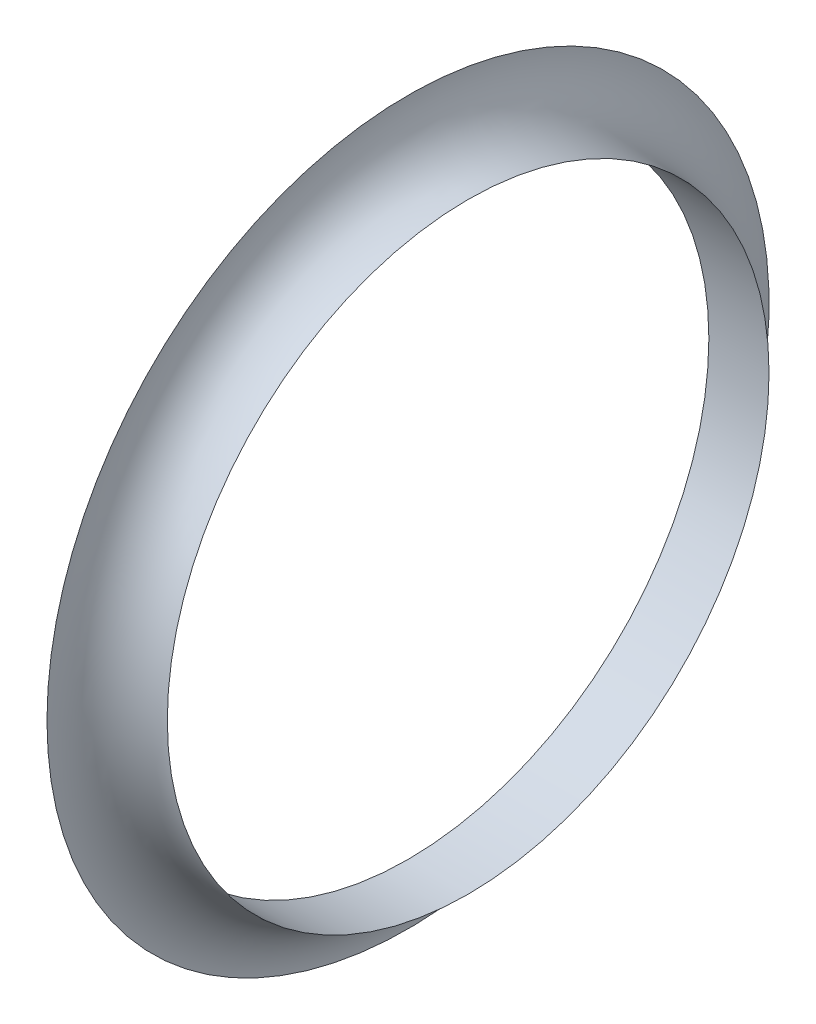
ISO-10303-21;
HEADER;
FILE_DESCRIPTION(('STEP AP214'),'2;1');
FILE_NAME('part.step','',(''),(''),'','','');
FILE_SCHEMA(('AUTOMOTIVE_DESIGN { 1 0 10303 214 1 1 1 1 }'));
ENDSEC;
DATA;
#1=APPLICATION_CONTEXT('core data for automotive mechanical design processes');
#2=APPLICATION_PROTOCOL_DEFINITION('international standard','automotive_design',2000,#1);
#3=PRODUCT_CONTEXT('',#1,'mechanical');
#4=PRODUCT('Part','Part','',(#3));
#5=PRODUCT_RELATED_PRODUCT_CATEGORY('part','',(#4));
#6=PRODUCT_DEFINITION_FORMATION('','',#4);
#7=PRODUCT_DEFINITION_CONTEXT('part definition',#1,'design');
#8=PRODUCT_DEFINITION('design','',#6,#7);
#9=PRODUCT_DEFINITION_SHAPE('','',#8);
#10=(LENGTH_UNIT() NAMED_UNIT(*) SI_UNIT(.MILLI.,.METRE.));
#11=(NAMED_UNIT(*) PLANE_ANGLE_UNIT() SI_UNIT($,.RADIAN.));
#12=(NAMED_UNIT(*) SI_UNIT($,.STERADIAN.) SOLID_ANGLE_UNIT());
#13=UNCERTAINTY_MEASURE_WITH_UNIT(LENGTH_MEASURE(1.E-05),#10,'distance_accuracy_value','');
#14=(GEOMETRIC_REPRESENTATION_CONTEXT(3) GLOBAL_UNCERTAINTY_ASSIGNED_CONTEXT((#13)) GLOBAL_UNIT_ASSIGNED_CONTEXT((#10,
#11,#12)) REPRESENTATION_CONTEXT('',''));
#15=CARTESIAN_POINT('',(0.,0.,0.));
#16=DIRECTION('',(0.,0.,1.));
#17=DIRECTION('',(1.,0.,0.));
#18=AXIS2_PLACEMENT_3D('',#15,#16,#17);
#19=CARTESIAN_POINT('',(0.,0.,0.));
#20=DIRECTION('',(-1.,0.,0.));
#21=DIRECTION('',(0.,0.,1.));
#22=AXIS2_PLACEMENT_3D('',#19,#20,#21);
#23=TOROIDAL_SURFACE('',#22,30.,5.);
#24=CARTESIAN_POINT('',(-5.,0.,0.));
#25=DIRECTION('',(-1.,0.,0.));
#26=DIRECTION('',(0.,0.,1.));
#27=AXIS2_PLACEMENT_3D('',#24,#25,#26);
#28=CIRCLE('',#27,30.);
#29=CARTESIAN_POINT('',(-5.,0.,30.));
#30=VERTEX_POINT('',#29);
#31=EDGE_CURVE('E10',#30,#30,#28,.T.);
#32=ORIENTED_EDGE('',*,*,#31,.F.);
#33=EDGE_LOOP('',(#32));
#34=FACE_BOUND('',#33,.T.);
#35=CARTESIAN_POINT('',(0.,0.,0.));
#36=DIRECTION('',(-1.,0.,0.));
#37=DIRECTION('',(0.,0.,1.));
#38=AXIS2_PLACEMENT_3D('',#35,#36,#37);
#39=CIRCLE('',#38,25.);
#40=CARTESIAN_POINT('',(0.,0.,25.));
#41=VERTEX_POINT('',#40);
#42=EDGE_CURVE('E39',#41,#41,#39,.T.);
#43=ORIENTED_EDGE('',*,*,#42,.T.);
#44=EDGE_LOOP('',(#43));
#45=FACE_BOUND('',#44,.T.);
#46=ADVANCED_FACE('F29',(#34,#45),#23,.F.);
#47=CARTESIAN_POINT('',(-5.,30.,0.));
#48=DIRECTION('',(1.,0.,0.));
#49=DIRECTION('',(0.,0.,-1.));
#50=AXIS2_PLACEMENT_3D('',#47,#48,#49);
#51=PLANE('',#50);
#52=CARTESIAN_POINT('',(-5.,0.,0.));
#53=DIRECTION('',(-1.,0.,0.));
#54=DIRECTION('',(0.,0.,1.));
#55=AXIS2_PLACEMENT_3D('',#52,#53,#54);
#56=CIRCLE('',#55,25.);
#57=CARTESIAN_POINT('',(-5.,0.,25.));
#58=VERTEX_POINT('',#57);
#59=EDGE_CURVE('E35',#58,#58,#56,.T.);
#60=ORIENTED_EDGE('',*,*,#59,.F.);
#61=EDGE_LOOP('',(#60));
#62=FACE_BOUND('',#61,.T.);
#63=ORIENTED_EDGE('',*,*,#31,.T.);
#64=EDGE_LOOP('',(#63));
#65=FACE_BOUND('',#64,.T.);
#66=ADVANCED_FACE('F49',(#62,#65),#51,.F.);
#67=CARTESIAN_POINT('',(0.,0.,0.));
#68=DIRECTION('',(-1.,0.,0.));
#69=DIRECTION('',(0.,0.,1.));
#70=AXIS2_PLACEMENT_3D('',#67,#68,#69);
#71=CYLINDRICAL_SURFACE('',#70,25.);
#72=ORIENTED_EDGE('',*,*,#42,.F.);
#73=EDGE_LOOP('',(#72));
#74=FACE_BOUND('',#73,.T.);
#75=ORIENTED_EDGE('',*,*,#59,.T.);
#76=EDGE_LOOP('',(#75));
#77=FACE_BOUND('',#76,.T.);
#78=ADVANCED_FACE('F47',(#74,#77),#71,.F.);
#79=CLOSED_SHELL('',(#46,#66,#78));
#80=MANIFOLD_SOLID_BREP('B2',#79);
#81=ADVANCED_BREP_SHAPE_REPRESENTATION('',(#18,#80),#14);
#82=SHAPE_DEFINITION_REPRESENTATION(#9,#81);
ENDSEC;
END-ISO-10303-21;
